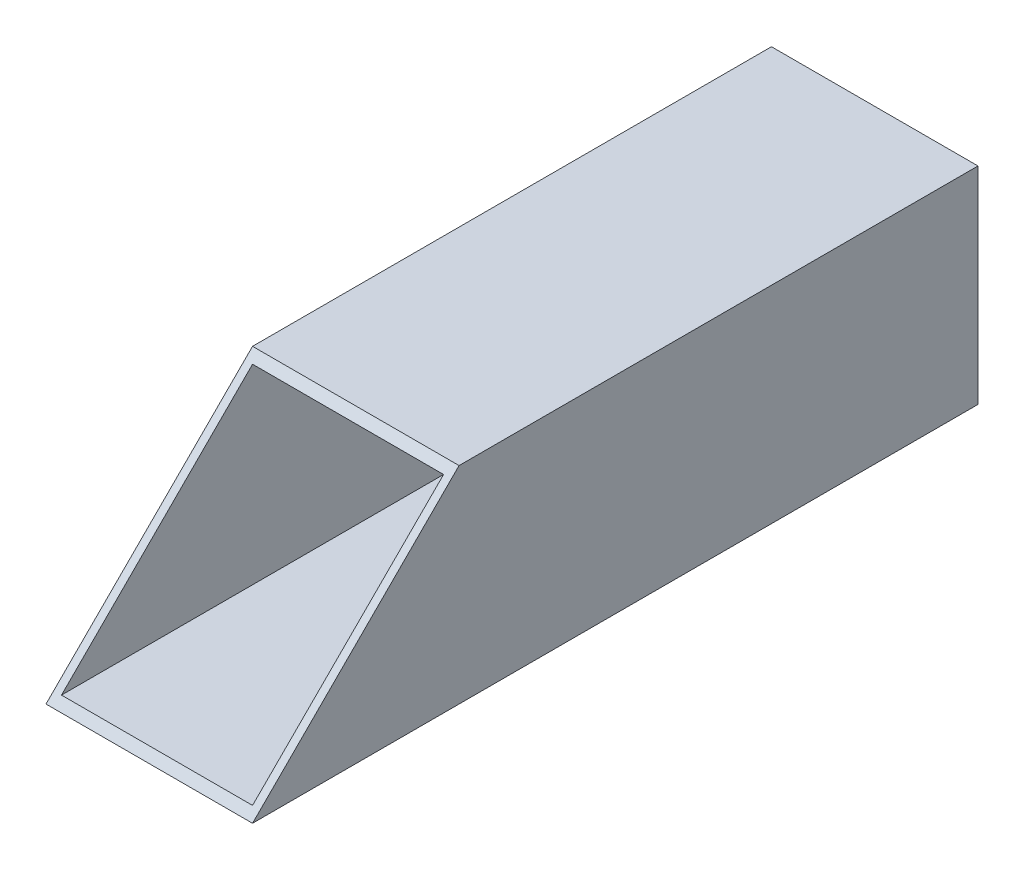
ISO-10303-21;
HEADER;
FILE_DESCRIPTION(('STEP AP214'),'2;1');
FILE_NAME('part.step','',(''),(''),'','','');
FILE_SCHEMA(('AUTOMOTIVE_DESIGN { 1 0 10303 214 1 1 1 1 }'));
ENDSEC;
DATA;
#1=APPLICATION_CONTEXT('core data for automotive mechanical design processes');
#2=APPLICATION_PROTOCOL_DEFINITION('international standard','automotive_design',2000,#1);
#3=PRODUCT_CONTEXT('',#1,'mechanical');
#4=PRODUCT('Part','Part','',(#3));
#5=PRODUCT_RELATED_PRODUCT_CATEGORY('part','',(#4));
#6=PRODUCT_DEFINITION_FORMATION('','',#4);
#7=PRODUCT_DEFINITION_CONTEXT('part definition',#1,'design');
#8=PRODUCT_DEFINITION('design','',#6,#7);
#9=PRODUCT_DEFINITION_SHAPE('','',#8);
#10=(LENGTH_UNIT() NAMED_UNIT(*) SI_UNIT(.MILLI.,.METRE.));
#11=(NAMED_UNIT(*) PLANE_ANGLE_UNIT() SI_UNIT($,.RADIAN.));
#12=(NAMED_UNIT(*) SI_UNIT($,.STERADIAN.) SOLID_ANGLE_UNIT());
#13=UNCERTAINTY_MEASURE_WITH_UNIT(LENGTH_MEASURE(1.E-05),#10,'distance_accuracy_value','');
#14=(GEOMETRIC_REPRESENTATION_CONTEXT(3) GLOBAL_UNCERTAINTY_ASSIGNED_CONTEXT((#13)) GLOBAL_UNIT_ASSIGNED_CONTEXT((#10,
#11,#12)) REPRESENTATION_CONTEXT('',''));
#15=CARTESIAN_POINT('',(0.,0.,0.));
#16=DIRECTION('',(0.,0.,1.));
#17=DIRECTION('',(1.,0.,0.));
#18=AXIS2_PLACEMENT_3D('',#15,#16,#17);
#19=CARTESIAN_POINT('',(0.,0.,0.));
#20=DIRECTION('',(0.,0.,1.));
#21=DIRECTION('',(1.,0.,0.));
#22=AXIS2_PLACEMENT_3D('',#19,#20,#21);
#23=PLANE('',#22);
#24=DIRECTION('',(0.,-1.,0.));
#25=VECTOR('',#24,1.);
#26=CARTESIAN_POINT('',(0.,80.,0.));
#27=LINE('',#26,#25);
#28=CARTESIAN_POINT('',(0.,80.,0.));
#29=VERTEX_POINT('',#28);
#30=CARTESIAN_POINT('',(0.,0.,0.));
#31=VERTEX_POINT('',#30);
#32=EDGE_CURVE('E129',#29,#31,#27,.T.);
#33=ORIENTED_EDGE('',*,*,#32,.F.);
#34=DIRECTION('',(-1.,0.,0.));
#35=VECTOR('',#34,1.);
#36=CARTESIAN_POINT('',(0.,80.,0.));
#37=LINE('',#36,#35);
#38=CARTESIAN_POINT('',(80.,80.,0.));
#39=VERTEX_POINT('',#38);
#40=EDGE_CURVE('E136',#39,#29,#37,.T.);
#41=ORIENTED_EDGE('',*,*,#40,.F.);
#42=DIRECTION('',(0.,1.,0.));
#43=VECTOR('',#42,1.);
#44=CARTESIAN_POINT('',(80.,80.,0.));
#45=LINE('',#44,#43);
#46=CARTESIAN_POINT('',(80.,0.,0.));
#47=VERTEX_POINT('',#46);
#48=EDGE_CURVE('E133',#47,#39,#45,.T.);
#49=ORIENTED_EDGE('',*,*,#48,.F.);
#50=DIRECTION('',(1.,0.,0.));
#51=VECTOR('',#50,1.);
#52=CARTESIAN_POINT('',(0.,0.,0.));
#53=LINE('',#52,#51);
#54=EDGE_CURVE('E77',#31,#47,#53,.T.);
#55=ORIENTED_EDGE('',*,*,#54,.F.);
#56=EDGE_LOOP('',(#33,#41,#49,#55));
#57=FACE_BOUND('',#56,.T.);
#58=DIRECTION('',(0.,-1.,0.));
#59=VECTOR('',#58,1.);
#60=CARTESIAN_POINT('',(3.,77.,0.));
#61=LINE('',#60,#59);
#62=CARTESIAN_POINT('',(3.,77.,0.));
#63=VERTEX_POINT('',#62);
#64=CARTESIAN_POINT('',(3.,3.,0.));
#65=VERTEX_POINT('',#64);
#66=EDGE_CURVE('E97',#63,#65,#61,.T.);
#67=ORIENTED_EDGE('',*,*,#66,.T.);
#68=DIRECTION('',(1.,0.,0.));
#69=VECTOR('',#68,1.);
#70=CARTESIAN_POINT('',(3.,3.,0.));
#71=LINE('',#70,#69);
#72=CARTESIAN_POINT('',(77.,3.,0.));
#73=VERTEX_POINT('',#72);
#74=EDGE_CURVE('E108',#65,#73,#71,.T.);
#75=ORIENTED_EDGE('',*,*,#74,.T.);
#76=DIRECTION('',(0.,1.,0.));
#77=VECTOR('',#76,1.);
#78=CARTESIAN_POINT('',(77.,77.,0.));
#79=LINE('',#78,#77);
#80=CARTESIAN_POINT('',(77.,77.,0.));
#81=VERTEX_POINT('',#80);
#82=EDGE_CURVE('E117',#73,#81,#79,.T.);
#83=ORIENTED_EDGE('',*,*,#82,.T.);
#84=DIRECTION('',(-1.,0.,0.));
#85=VECTOR('',#84,1.);
#86=CARTESIAN_POINT('',(3.,77.,0.));
#87=LINE('',#86,#85);
#88=EDGE_CURVE('E112',#81,#63,#87,.T.);
#89=ORIENTED_EDGE('',*,*,#88,.T.);
#90=EDGE_LOOP('',(#67,#75,#83,#89));
#91=FACE_BOUND('',#90,.T.);
#92=ADVANCED_FACE('F32',(#57,#91),#23,.F.);
#93=CARTESIAN_POINT('',(0.,80.,281.));
#94=DIRECTION('',(1.,0.,0.));
#95=DIRECTION('',(0.,1.,0.));
#96=AXIS2_PLACEMENT_3D('',#93,#94,#95);
#97=PLANE('',#96);
#98=DIRECTION('',(0.,0.,-1.));
#99=VECTOR('',#98,1.);
#100=CARTESIAN_POINT('',(0.,0.,281.));
#101=LINE('',#100,#99);
#102=CARTESIAN_POINT('',(0.,0.,281.));
#103=VERTEX_POINT('',#102);
#104=EDGE_CURVE('E149',#103,#31,#101,.T.);
#105=ORIENTED_EDGE('',*,*,#104,.F.);
#106=DIRECTION('',(0.,0.707106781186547,-0.707106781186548));
#107=VECTOR('',#106,1.);
#108=CARTESIAN_POINT('',(0.,-2.91433543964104E-13,281.));
#109=LINE('',#108,#107);
#110=CARTESIAN_POINT('',(0.,80.,201.));
#111=VERTEX_POINT('',#110);
#112=EDGE_CURVE('E151',#103,#111,#109,.T.);
#113=ORIENTED_EDGE('',*,*,#112,.T.);
#114=DIRECTION('',(0.,0.,-1.));
#115=VECTOR('',#114,1.);
#116=CARTESIAN_POINT('',(0.,80.,281.));
#117=LINE('',#116,#115);
#118=EDGE_CURVE('E142',#111,#29,#117,.T.);
#119=ORIENTED_EDGE('',*,*,#118,.T.);
#120=ORIENTED_EDGE('',*,*,#32,.T.);
#121=EDGE_LOOP('',(#105,#113,#119,#120));
#122=FACE_BOUND('',#121,.T.);
#123=ADVANCED_FACE('F178',(#122),#97,.F.);
#124=CARTESIAN_POINT('',(0.,0.,281.));
#125=DIRECTION('',(0.,1.,0.));
#126=DIRECTION('',(0.,0.,1.));
#127=AXIS2_PLACEMENT_3D('',#124,#125,#126);
#128=PLANE('',#127);
#129=ORIENTED_EDGE('',*,*,#54,.T.);
#130=DIRECTION('',(0.,0.,-1.));
#131=VECTOR('',#130,1.);
#132=CARTESIAN_POINT('',(80.,0.,281.));
#133=LINE('',#132,#131);
#134=CARTESIAN_POINT('',(80.,0.,281.));
#135=VERTEX_POINT('',#134);
#136=EDGE_CURVE('E146',#135,#47,#133,.T.);
#137=ORIENTED_EDGE('',*,*,#136,.F.);
#138=DIRECTION('',(1.,0.,0.));
#139=VECTOR('',#138,1.);
#140=CARTESIAN_POINT('',(0.,0.,281.));
#141=LINE('',#140,#139);
#142=EDGE_CURVE('E139',#103,#135,#141,.T.);
#143=ORIENTED_EDGE('',*,*,#142,.F.);
#144=ORIENTED_EDGE('',*,*,#104,.T.);
#145=EDGE_LOOP('',(#129,#137,#143,#144));
#146=FACE_BOUND('',#145,.T.);
#147=ADVANCED_FACE('F183',(#146),#128,.F.);
#148=CARTESIAN_POINT('',(80.,80.,281.));
#149=DIRECTION('',(-1.,0.,0.));
#150=DIRECTION('',(0.,-1.,0.));
#151=AXIS2_PLACEMENT_3D('',#148,#149,#150);
#152=PLANE('',#151);
#153=DIRECTION('',(0.,0.,-1.));
#154=VECTOR('',#153,1.);
#155=CARTESIAN_POINT('',(80.,80.,281.));
#156=LINE('',#155,#154);
#157=CARTESIAN_POINT('',(80.,80.,201.));
#158=VERTEX_POINT('',#157);
#159=EDGE_CURVE('E144',#158,#39,#156,.T.);
#160=ORIENTED_EDGE('',*,*,#159,.F.);
#161=DIRECTION('',(0.,-0.707106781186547,0.707106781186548));
#162=VECTOR('',#161,1.);
#163=CARTESIAN_POINT('',(80.,-2.98372437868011E-13,281.));
#164=LINE('',#163,#162);
#165=EDGE_CURVE('E11',#158,#135,#164,.T.);
#166=ORIENTED_EDGE('',*,*,#165,.T.);
#167=ORIENTED_EDGE('',*,*,#136,.T.);
#168=ORIENTED_EDGE('',*,*,#48,.T.);
#169=EDGE_LOOP('',(#160,#166,#167,#168));
#170=FACE_BOUND('',#169,.T.);
#171=ADVANCED_FACE('F188',(#170),#152,.F.);
#172=CARTESIAN_POINT('',(0.,80.,281.));
#173=DIRECTION('',(0.,-1.,0.));
#174=DIRECTION('',(0.,0.,-1.));
#175=AXIS2_PLACEMENT_3D('',#172,#173,#174);
#176=PLANE('',#175);
#177=ORIENTED_EDGE('',*,*,#118,.F.);
#178=DIRECTION('',(1.,0.,0.));
#179=VECTOR('',#178,1.);
#180=CARTESIAN_POINT('',(80.,80.,201.));
#181=LINE('',#180,#179);
#182=EDGE_CURVE('E42',#111,#158,#181,.T.);
#183=ORIENTED_EDGE('',*,*,#182,.T.);
#184=ORIENTED_EDGE('',*,*,#159,.T.);
#185=ORIENTED_EDGE('',*,*,#40,.T.);
#186=EDGE_LOOP('',(#177,#183,#184,#185));
#187=FACE_BOUND('',#186,.T.);
#188=ADVANCED_FACE('F175',(#187),#176,.F.);
#189=CARTESIAN_POINT('',(3.,77.,281.));
#190=DIRECTION('',(1.,0.,0.));
#191=DIRECTION('',(0.,1.,0.));
#192=AXIS2_PLACEMENT_3D('',#189,#190,#191);
#193=PLANE('',#192);
#194=ORIENTED_EDGE('',*,*,#66,.F.);
#195=DIRECTION('',(0.,0.,-1.));
#196=VECTOR('',#195,1.);
#197=CARTESIAN_POINT('',(3.,77.,281.));
#198=LINE('',#197,#196);
#199=CARTESIAN_POINT('',(3.,77.,204.));
#200=VERTEX_POINT('',#199);
#201=EDGE_CURVE('E100',#200,#63,#198,.T.);
#202=ORIENTED_EDGE('',*,*,#201,.F.);
#203=DIRECTION('',(0.,-0.707106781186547,0.707106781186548));
#204=VECTOR('',#203,1.);
#205=CARTESIAN_POINT('',(3.,38.4999999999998,242.5));
#206=LINE('',#205,#204);
#207=CARTESIAN_POINT('',(3.,3.,278.));
#208=VERTEX_POINT('',#207);
#209=EDGE_CURVE('E36',#200,#208,#206,.T.);
#210=ORIENTED_EDGE('',*,*,#209,.T.);
#211=DIRECTION('',(0.,0.,-1.));
#212=VECTOR('',#211,1.);
#213=CARTESIAN_POINT('',(3.,3.,281.));
#214=LINE('',#213,#212);
#215=EDGE_CURVE('E104',#208,#65,#214,.T.);
#216=ORIENTED_EDGE('',*,*,#215,.T.);
#217=EDGE_LOOP('',(#194,#202,#210,#216));
#218=FACE_BOUND('',#217,.T.);
#219=ADVANCED_FACE('F98',(#218),#193,.T.);
#220=CARTESIAN_POINT('',(3.,3.,281.));
#221=DIRECTION('',(0.,1.,0.));
#222=DIRECTION('',(0.,0.,1.));
#223=AXIS2_PLACEMENT_3D('',#220,#221,#222);
#224=PLANE('',#223);
#225=ORIENTED_EDGE('',*,*,#74,.F.);
#226=ORIENTED_EDGE('',*,*,#215,.F.);
#227=DIRECTION('',(1.,0.,0.));
#228=VECTOR('',#227,1.);
#229=CARTESIAN_POINT('',(3.,3.,278.));
#230=LINE('',#229,#228);
#231=CARTESIAN_POINT('',(77.,3.,278.));
#232=VERTEX_POINT('',#231);
#233=EDGE_CURVE('E119',#208,#232,#230,.T.);
#234=ORIENTED_EDGE('',*,*,#233,.T.);
#235=DIRECTION('',(0.,0.,-1.));
#236=VECTOR('',#235,1.);
#237=CARTESIAN_POINT('',(77.,3.,281.));
#238=LINE('',#237,#236);
#239=EDGE_CURVE('E125',#232,#73,#238,.T.);
#240=ORIENTED_EDGE('',*,*,#239,.T.);
#241=EDGE_LOOP('',(#225,#226,#234,#240));
#242=FACE_BOUND('',#241,.T.);
#243=ADVANCED_FACE('F165',(#242),#224,.T.);
#244=CARTESIAN_POINT('',(77.,77.,281.));
#245=DIRECTION('',(-1.,0.,0.));
#246=DIRECTION('',(0.,-1.,0.));
#247=AXIS2_PLACEMENT_3D('',#244,#245,#246);
#248=PLANE('',#247);
#249=ORIENTED_EDGE('',*,*,#82,.F.);
#250=ORIENTED_EDGE('',*,*,#239,.F.);
#251=DIRECTION('',(0.,0.707106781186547,-0.707106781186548));
#252=VECTOR('',#251,1.);
#253=CARTESIAN_POINT('',(77.,38.4999999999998,242.5));
#254=LINE('',#253,#252);
#255=CARTESIAN_POINT('',(77.,77.,204.));
#256=VERTEX_POINT('',#255);
#257=EDGE_CURVE('E155',#232,#256,#254,.T.);
#258=ORIENTED_EDGE('',*,*,#257,.T.);
#259=DIRECTION('',(0.,0.,-1.));
#260=VECTOR('',#259,1.);
#261=CARTESIAN_POINT('',(77.,77.,281.));
#262=LINE('',#261,#260);
#263=EDGE_CURVE('E114',#256,#81,#262,.T.);
#264=ORIENTED_EDGE('',*,*,#263,.T.);
#265=EDGE_LOOP('',(#249,#250,#258,#264));
#266=FACE_BOUND('',#265,.T.);
#267=ADVANCED_FACE('F160',(#266),#248,.T.);
#268=CARTESIAN_POINT('',(3.,77.,281.));
#269=DIRECTION('',(0.,-1.,0.));
#270=DIRECTION('',(0.,0.,-1.));
#271=AXIS2_PLACEMENT_3D('',#268,#269,#270);
#272=PLANE('',#271);
#273=ORIENTED_EDGE('',*,*,#88,.F.);
#274=ORIENTED_EDGE('',*,*,#263,.F.);
#275=DIRECTION('',(-1.,0.,0.));
#276=VECTOR('',#275,1.);
#277=CARTESIAN_POINT('',(3.,77.,204.));
#278=LINE('',#277,#276);
#279=EDGE_CURVE('E68',#256,#200,#278,.T.);
#280=ORIENTED_EDGE('',*,*,#279,.T.);
#281=ORIENTED_EDGE('',*,*,#201,.T.);
#282=EDGE_LOOP('',(#273,#274,#280,#281));
#283=FACE_BOUND('',#282,.T.);
#284=ADVANCED_FACE('F111',(#283),#272,.T.);
#285=CARTESIAN_POINT('',(0.,-2.91433543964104E-13,281.));
#286=DIRECTION('',(0.,0.707106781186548,0.707106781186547));
#287=DIRECTION('',(0.,-0.707106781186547,0.707106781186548));
#288=AXIS2_PLACEMENT_3D('',#285,#286,#287);
#289=PLANE('',#288);
#290=ORIENTED_EDGE('',*,*,#165,.F.);
#291=ORIENTED_EDGE('',*,*,#182,.F.);
#292=ORIENTED_EDGE('',*,*,#112,.F.);
#293=ORIENTED_EDGE('',*,*,#142,.T.);
#294=EDGE_LOOP('',(#290,#291,#292,#293));
#295=FACE_BOUND('',#294,.T.);
#296=ORIENTED_EDGE('',*,*,#233,.F.);
#297=ORIENTED_EDGE('',*,*,#209,.F.);
#298=ORIENTED_EDGE('',*,*,#279,.F.);
#299=ORIENTED_EDGE('',*,*,#257,.F.);
#300=EDGE_LOOP('',(#296,#297,#298,#299));
#301=FACE_BOUND('',#300,.T.);
#302=ADVANCED_FACE('F34',(#295,#301),#289,.T.);
#303=CLOSED_SHELL('',(#92,#123,#147,#171,#188,#219,#243,#267,#284,#302));
#304=MANIFOLD_SOLID_BREP('B2',#303);
#305=ADVANCED_BREP_SHAPE_REPRESENTATION('',(#18,#304),#14);
#306=SHAPE_DEFINITION_REPRESENTATION(#9,#305);
ENDSEC;
END-ISO-10303-21;
